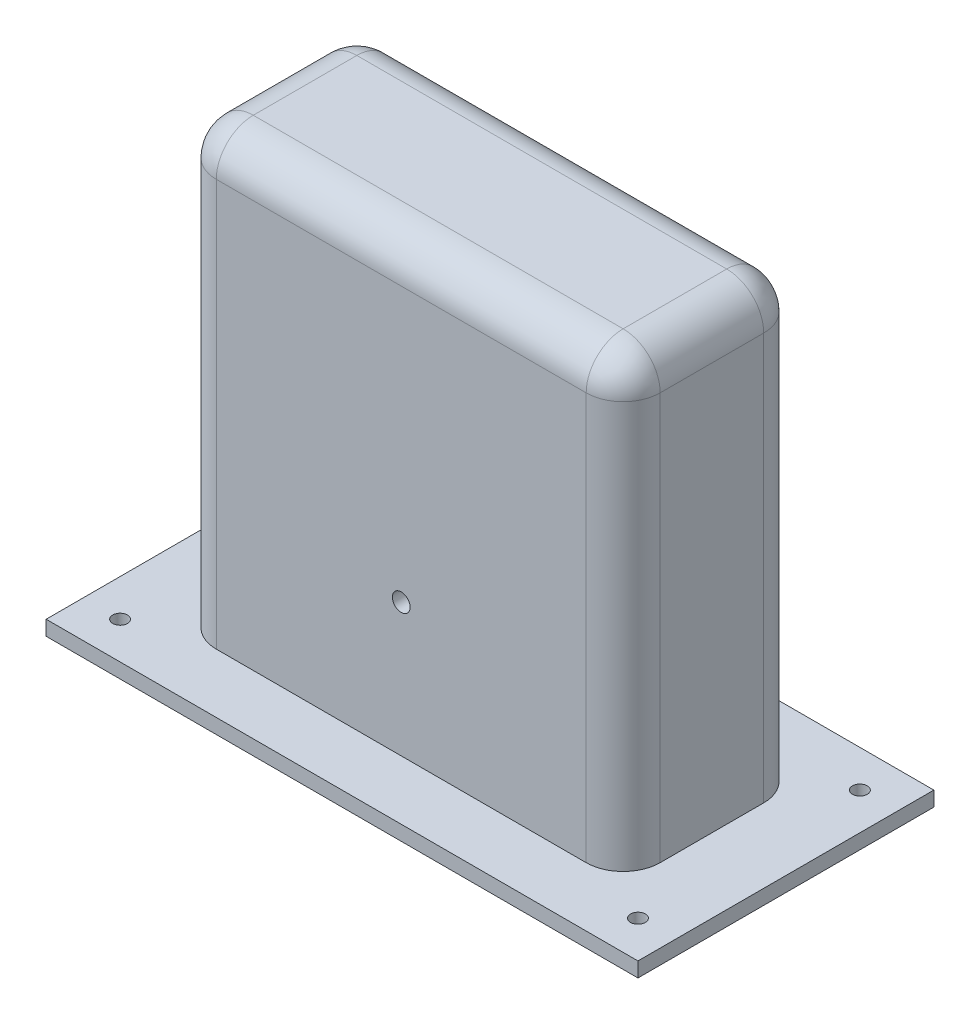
ISO-10303-21;
HEADER;
FILE_DESCRIPTION(('STEP AP214'),'2;1');
FILE_NAME('part.step','',(''),(''),'','','');
FILE_SCHEMA(('AUTOMOTIVE_DESIGN { 1 0 10303 214 1 1 1 1 }'));
ENDSEC;
DATA;
#1=APPLICATION_CONTEXT('core data for automotive mechanical design processes');
#2=APPLICATION_PROTOCOL_DEFINITION('international standard','automotive_design',2000,#1);
#3=PRODUCT_CONTEXT('',#1,'mechanical');
#4=PRODUCT('Part','Part','',(#3));
#5=PRODUCT_RELATED_PRODUCT_CATEGORY('part','',(#4));
#6=PRODUCT_DEFINITION_FORMATION('','',#4);
#7=PRODUCT_DEFINITION_CONTEXT('part definition',#1,'design');
#8=PRODUCT_DEFINITION('design','',#6,#7);
#9=PRODUCT_DEFINITION_SHAPE('','',#8);
#10=(LENGTH_UNIT() NAMED_UNIT(*) SI_UNIT(.MILLI.,.METRE.));
#11=(NAMED_UNIT(*) PLANE_ANGLE_UNIT() SI_UNIT($,.RADIAN.));
#12=(NAMED_UNIT(*) SI_UNIT($,.STERADIAN.) SOLID_ANGLE_UNIT());
#13=UNCERTAINTY_MEASURE_WITH_UNIT(LENGTH_MEASURE(1.E-05),#10,'distance_accuracy_value','');
#14=(GEOMETRIC_REPRESENTATION_CONTEXT(3) GLOBAL_UNCERTAINTY_ASSIGNED_CONTEXT((#13)) GLOBAL_UNIT_ASSIGNED_CONTEXT((#10,
#11,#12)) REPRESENTATION_CONTEXT('',''));
#15=CARTESIAN_POINT('',(0.,0.,0.));
#16=DIRECTION('',(0.,0.,1.));
#17=DIRECTION('',(1.,0.,0.));
#18=AXIS2_PLACEMENT_3D('',#15,#16,#17);
#19=CARTESIAN_POINT('',(0.,10.,0.));
#20=DIRECTION('',(0.,1.,0.));
#21=DIRECTION('',(0.,0.,1.));
#22=AXIS2_PLACEMENT_3D('',#19,#20,#21);
#23=PLANE('',#22);
#24=CARTESIAN_POINT('',(-175.,10.,-75.));
#25=DIRECTION('',(0.,1.,0.));
#26=DIRECTION('',(0.,0.,1.));
#27=AXIS2_PLACEMENT_3D('',#24,#25,#26);
#28=CIRCLE('',#27,5.00000000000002);
#29=CARTESIAN_POINT('',(-175.,10.,-70.));
#30=VERTEX_POINT('',#29);
#31=EDGE_CURVE('E445',#30,#30,#28,.T.);
#32=ORIENTED_EDGE('',*,*,#31,.F.);
#33=EDGE_LOOP('',(#32));
#34=FACE_BOUND('',#33,.T.);
#35=CARTESIAN_POINT('',(175.,10.,-75.));
#36=DIRECTION('',(0.,1.,0.));
#37=DIRECTION('',(0.,0.,1.));
#38=AXIS2_PLACEMENT_3D('',#35,#36,#37);
#39=CIRCLE('',#38,5.00000000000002);
#40=CARTESIAN_POINT('',(175.,10.,-70.));
#41=VERTEX_POINT('',#40);
#42=EDGE_CURVE('E457',#41,#41,#39,.T.);
#43=ORIENTED_EDGE('',*,*,#42,.F.);
#44=EDGE_LOOP('',(#43));
#45=FACE_BOUND('',#44,.T.);
#46=DIRECTION('',(0.,0.,-1.));
#47=VECTOR('',#46,1.);
#48=CARTESIAN_POINT('',(200.,10.,-100.));
#49=LINE('',#48,#47);
#50=CARTESIAN_POINT('',(200.,10.,100.));
#51=VERTEX_POINT('',#50);
#52=CARTESIAN_POINT('',(200.,10.,-100.));
#53=VERTEX_POINT('',#52);
#54=EDGE_CURVE('E208',#51,#53,#49,.T.);
#55=ORIENTED_EDGE('',*,*,#54,.T.);
#56=DIRECTION('',(-1.,0.,0.));
#57=VECTOR('',#56,1.);
#58=CARTESIAN_POINT('',(-200.,10.,-100.));
#59=LINE('',#58,#57);
#60=CARTESIAN_POINT('',(-200.,10.,-100.));
#61=VERTEX_POINT('',#60);
#62=EDGE_CURVE('E197',#53,#61,#59,.T.);
#63=ORIENTED_EDGE('',*,*,#62,.T.);
#64=DIRECTION('',(0.,0.,1.));
#65=VECTOR('',#64,1.);
#66=CARTESIAN_POINT('',(-200.,10.,-100.));
#67=LINE('',#66,#65);
#68=CARTESIAN_POINT('',(-200.,10.,100.));
#69=VERTEX_POINT('',#68);
#70=EDGE_CURVE('E207',#61,#69,#67,.T.);
#71=ORIENTED_EDGE('',*,*,#70,.T.);
#72=DIRECTION('',(1.,0.,0.));
#73=VECTOR('',#72,1.);
#74=CARTESIAN_POINT('',(-200.,10.,100.));
#75=LINE('',#74,#73);
#76=EDGE_CURVE('E213',#69,#51,#75,.T.);
#77=ORIENTED_EDGE('',*,*,#76,.T.);
#78=EDGE_LOOP('',(#55,#63,#71,#77));
#79=FACE_BOUND('',#78,.T.);
#80=CARTESIAN_POINT('',(175.,10.,75.0000000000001));
#81=DIRECTION('',(0.,1.,0.));
#82=DIRECTION('',(0.,0.,1.));
#83=AXIS2_PLACEMENT_3D('',#80,#81,#82);
#84=CIRCLE('',#83,5.00000000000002);
#85=CARTESIAN_POINT('',(175.,10.,80.0000000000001));
#86=VERTEX_POINT('',#85);
#87=EDGE_CURVE('E451',#86,#86,#84,.T.);
#88=ORIENTED_EDGE('',*,*,#87,.F.);
#89=EDGE_LOOP('',(#88));
#90=FACE_BOUND('',#89,.T.);
#91=CARTESIAN_POINT('',(-175.,10.,75.0000000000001));
#92=DIRECTION('',(0.,1.,0.));
#93=DIRECTION('',(0.,0.,1.));
#94=AXIS2_PLACEMENT_3D('',#91,#92,#93);
#95=CIRCLE('',#94,5.00000000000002);
#96=CARTESIAN_POINT('',(-175.,10.,80.0000000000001));
#97=VERTEX_POINT('',#96);
#98=EDGE_CURVE('E439',#97,#97,#95,.T.);
#99=ORIENTED_EDGE('',*,*,#98,.F.);
#100=EDGE_LOOP('',(#99));
#101=FACE_BOUND('',#100,.T.);
#102=DIRECTION('',(-1.,0.,0.));
#103=VECTOR('',#102,1.);
#104=CARTESIAN_POINT('',(-150.,10.,-60.));
#105=LINE('',#104,#103);
#106=CARTESIAN_POINT('',(125.,10.,-60.));
#107=VERTEX_POINT('',#106);
#108=CARTESIAN_POINT('',(-125.,10.,-60.));
#109=VERTEX_POINT('',#108);
#110=EDGE_CURVE('E431',#107,#109,#105,.T.);
#111=ORIENTED_EDGE('',*,*,#110,.F.);
#112=CARTESIAN_POINT('',(125.,10.,-35.));
#113=DIRECTION('',(0.,1.,0.));
#114=DIRECTION('',(0.,0.,1.));
#115=AXIS2_PLACEMENT_3D('',#112,#113,#114);
#116=CIRCLE('',#115,25.);
#117=CARTESIAN_POINT('',(150.,10.,-35.));
#118=VERTEX_POINT('',#117);
#119=EDGE_CURVE('E315',#107,#118,#116,.F.);
#120=ORIENTED_EDGE('',*,*,#119,.T.);
#121=DIRECTION('',(0.,0.,-1.));
#122=VECTOR('',#121,1.);
#123=CARTESIAN_POINT('',(150.,10.,-60.));
#124=LINE('',#123,#122);
#125=CARTESIAN_POINT('',(150.,10.,35.));
#126=VERTEX_POINT('',#125);
#127=EDGE_CURVE('E355',#126,#118,#124,.T.);
#128=ORIENTED_EDGE('',*,*,#127,.F.);
#129=CARTESIAN_POINT('',(125.,10.,35.));
#130=DIRECTION('',(0.,1.,0.));
#131=DIRECTION('',(0.,0.,1.));
#132=AXIS2_PLACEMENT_3D('',#129,#130,#131);
#133=CIRCLE('',#132,25.);
#134=CARTESIAN_POINT('',(125.,10.,60.));
#135=VERTEX_POINT('',#134);
#136=EDGE_CURVE('E45',#126,#135,#133,.F.);
#137=ORIENTED_EDGE('',*,*,#136,.T.);
#138=DIRECTION('',(1.,0.,0.));
#139=VECTOR('',#138,1.);
#140=CARTESIAN_POINT('',(-150.,10.,60.));
#141=LINE('',#140,#139);
#142=CARTESIAN_POINT('',(-125.,10.,60.));
#143=VERTEX_POINT('',#142);
#144=EDGE_CURVE('E427',#143,#135,#141,.T.);
#145=ORIENTED_EDGE('',*,*,#144,.F.);
#146=CARTESIAN_POINT('',(-125.,10.,35.));
#147=DIRECTION('',(0.,1.,0.));
#148=DIRECTION('',(0.,0.,1.));
#149=AXIS2_PLACEMENT_3D('',#146,#147,#148);
#150=CIRCLE('',#149,25.);
#151=CARTESIAN_POINT('',(-150.,10.,35.));
#152=VERTEX_POINT('',#151);
#153=EDGE_CURVE('E11',#143,#152,#150,.F.);
#154=ORIENTED_EDGE('',*,*,#153,.T.);
#155=DIRECTION('',(0.,0.,1.));
#156=VECTOR('',#155,1.);
#157=CARTESIAN_POINT('',(-150.,10.,-60.));
#158=LINE('',#157,#156);
#159=CARTESIAN_POINT('',(-150.,10.,-35.));
#160=VERTEX_POINT('',#159);
#161=EDGE_CURVE('E425',#160,#152,#158,.T.);
#162=ORIENTED_EDGE('',*,*,#161,.F.);
#163=CARTESIAN_POINT('',(-125.,10.,-35.));
#164=DIRECTION('',(0.,1.,0.));
#165=DIRECTION('',(0.,0.,1.));
#166=AXIS2_PLACEMENT_3D('',#163,#164,#165);
#167=CIRCLE('',#166,25.);
#168=EDGE_CURVE('E313',#160,#109,#167,.F.);
#169=ORIENTED_EDGE('',*,*,#168,.T.);
#170=EDGE_LOOP('',(#111,#120,#128,#137,#145,#154,#162,#169));
#171=FACE_BOUND('',#170,.T.);
#172=ADVANCED_FACE('F36',(#34,#45,#79,#90,#101,#171),#23,.T.);
#173=CARTESIAN_POINT('',(0.,0.,0.));
#174=DIRECTION('',(0.,1.,0.));
#175=DIRECTION('',(0.,0.,1.));
#176=AXIS2_PLACEMENT_3D('',#173,#174,#175);
#177=PLANE('',#176);
#178=DIRECTION('',(0.,0.,-1.));
#179=VECTOR('',#178,1.);
#180=CARTESIAN_POINT('',(200.,0.,-100.));
#181=LINE('',#180,#179);
#182=CARTESIAN_POINT('',(200.,0.,100.));
#183=VERTEX_POINT('',#182);
#184=CARTESIAN_POINT('',(200.,0.,-100.));
#185=VERTEX_POINT('',#184);
#186=EDGE_CURVE('E221',#183,#185,#181,.T.);
#187=ORIENTED_EDGE('',*,*,#186,.F.);
#188=DIRECTION('',(1.,0.,0.));
#189=VECTOR('',#188,1.);
#190=CARTESIAN_POINT('',(-200.,0.,100.));
#191=LINE('',#190,#189);
#192=CARTESIAN_POINT('',(-200.,0.,100.));
#193=VERTEX_POINT('',#192);
#194=EDGE_CURVE('E217',#193,#183,#191,.T.);
#195=ORIENTED_EDGE('',*,*,#194,.F.);
#196=DIRECTION('',(0.,0.,1.));
#197=VECTOR('',#196,1.);
#198=CARTESIAN_POINT('',(-200.,0.,-100.));
#199=LINE('',#198,#197);
#200=CARTESIAN_POINT('',(-200.,0.,-100.));
#201=VERTEX_POINT('',#200);
#202=EDGE_CURVE('E468',#201,#193,#199,.T.);
#203=ORIENTED_EDGE('',*,*,#202,.F.);
#204=DIRECTION('',(-1.,0.,0.));
#205=VECTOR('',#204,1.);
#206=CARTESIAN_POINT('',(-200.,0.,-100.));
#207=LINE('',#206,#205);
#208=EDGE_CURVE('E466',#185,#201,#207,.T.);
#209=ORIENTED_EDGE('',*,*,#208,.F.);
#210=EDGE_LOOP('',(#187,#195,#203,#209));
#211=FACE_BOUND('',#210,.T.);
#212=CARTESIAN_POINT('',(175.,0.,-75.));
#213=DIRECTION('',(0.,1.,0.));
#214=DIRECTION('',(0.,0.,1.));
#215=AXIS2_PLACEMENT_3D('',#212,#213,#214);
#216=CIRCLE('',#215,5.00000000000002);
#217=CARTESIAN_POINT('',(175.,0.,-70.));
#218=VERTEX_POINT('',#217);
#219=EDGE_CURVE('E454',#218,#218,#216,.T.);
#220=ORIENTED_EDGE('',*,*,#219,.T.);
#221=EDGE_LOOP('',(#220));
#222=FACE_BOUND('',#221,.T.);
#223=CARTESIAN_POINT('',(175.,0.,75.0000000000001));
#224=DIRECTION('',(0.,1.,0.));
#225=DIRECTION('',(0.,0.,1.));
#226=AXIS2_PLACEMENT_3D('',#223,#224,#225);
#227=CIRCLE('',#226,5.00000000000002);
#228=CARTESIAN_POINT('',(175.,0.,80.0000000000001));
#229=VERTEX_POINT('',#228);
#230=EDGE_CURVE('E448',#229,#229,#227,.T.);
#231=ORIENTED_EDGE('',*,*,#230,.T.);
#232=EDGE_LOOP('',(#231));
#233=FACE_BOUND('',#232,.T.);
#234=CARTESIAN_POINT('',(-175.,0.,-75.));
#235=DIRECTION('',(0.,1.,0.));
#236=DIRECTION('',(0.,0.,1.));
#237=AXIS2_PLACEMENT_3D('',#234,#235,#236);
#238=CIRCLE('',#237,5.00000000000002);
#239=CARTESIAN_POINT('',(-175.,0.,-70.));
#240=VERTEX_POINT('',#239);
#241=EDGE_CURVE('E442',#240,#240,#238,.T.);
#242=ORIENTED_EDGE('',*,*,#241,.T.);
#243=EDGE_LOOP('',(#242));
#244=FACE_BOUND('',#243,.T.);
#245=CARTESIAN_POINT('',(-175.,0.,75.0000000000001));
#246=DIRECTION('',(0.,1.,0.));
#247=DIRECTION('',(0.,0.,1.));
#248=AXIS2_PLACEMENT_3D('',#245,#246,#247);
#249=CIRCLE('',#248,5.00000000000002);
#250=CARTESIAN_POINT('',(-175.,0.,80.0000000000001));
#251=VERTEX_POINT('',#250);
#252=EDGE_CURVE('E433',#251,#251,#249,.T.);
#253=ORIENTED_EDGE('',*,*,#252,.T.);
#254=EDGE_LOOP('',(#253));
#255=FACE_BOUND('',#254,.T.);
#256=ADVANCED_FACE('F479',(#211,#222,#233,#244,#255),#177,.F.);
#257=CARTESIAN_POINT('',(200.,10.,-100.));
#258=DIRECTION('',(-1.,0.,0.));
#259=DIRECTION('',(0.,0.,1.));
#260=AXIS2_PLACEMENT_3D('',#257,#258,#259);
#261=PLANE('',#260);
#262=ORIENTED_EDGE('',*,*,#186,.T.);
#263=DIRECTION('',(0.,-1.,0.));
#264=VECTOR('',#263,1.);
#265=CARTESIAN_POINT('',(200.,10.,-100.));
#266=LINE('',#265,#264);
#267=EDGE_CURVE('E201',#53,#185,#266,.T.);
#268=ORIENTED_EDGE('',*,*,#267,.F.);
#269=ORIENTED_EDGE('',*,*,#54,.F.);
#270=DIRECTION('',(0.,-1.,0.));
#271=VECTOR('',#270,1.);
#272=CARTESIAN_POINT('',(200.,10.,100.));
#273=LINE('',#272,#271);
#274=EDGE_CURVE('E464',#51,#183,#273,.T.);
#275=ORIENTED_EDGE('',*,*,#274,.T.);
#276=EDGE_LOOP('',(#262,#268,#269,#275));
#277=FACE_BOUND('',#276,.T.);
#278=ADVANCED_FACE('F219',(#277),#261,.F.);
#279=CARTESIAN_POINT('',(-200.,10.,-100.));
#280=DIRECTION('',(0.,0.,1.));
#281=DIRECTION('',(1.,0.,0.));
#282=AXIS2_PLACEMENT_3D('',#279,#280,#281);
#283=PLANE('',#282);
#284=ORIENTED_EDGE('',*,*,#208,.T.);
#285=DIRECTION('',(0.,-1.,0.));
#286=VECTOR('',#285,1.);
#287=CARTESIAN_POINT('',(-200.,10.,-100.));
#288=LINE('',#287,#286);
#289=EDGE_CURVE('E204',#61,#201,#288,.T.);
#290=ORIENTED_EDGE('',*,*,#289,.F.);
#291=ORIENTED_EDGE('',*,*,#62,.F.);
#292=ORIENTED_EDGE('',*,*,#267,.T.);
#293=EDGE_LOOP('',(#284,#290,#291,#292));
#294=FACE_BOUND('',#293,.T.);
#295=ADVANCED_FACE('F199',(#294),#283,.F.);
#296=CARTESIAN_POINT('',(-200.,10.,-100.));
#297=DIRECTION('',(1.,0.,0.));
#298=DIRECTION('',(0.,0.,-1.));
#299=AXIS2_PLACEMENT_3D('',#296,#297,#298);
#300=PLANE('',#299);
#301=ORIENTED_EDGE('',*,*,#202,.T.);
#302=DIRECTION('',(0.,-1.,0.));
#303=VECTOR('',#302,1.);
#304=CARTESIAN_POINT('',(-200.,10.,100.));
#305=LINE('',#304,#303);
#306=EDGE_CURVE('E227',#69,#193,#305,.T.);
#307=ORIENTED_EDGE('',*,*,#306,.F.);
#308=ORIENTED_EDGE('',*,*,#70,.F.);
#309=ORIENTED_EDGE('',*,*,#289,.T.);
#310=EDGE_LOOP('',(#301,#307,#308,#309));
#311=FACE_BOUND('',#310,.T.);
#312=ADVANCED_FACE('F481',(#311),#300,.F.);
#313=CARTESIAN_POINT('',(-200.,10.,100.));
#314=DIRECTION('',(0.,0.,-1.));
#315=DIRECTION('',(-1.,0.,0.));
#316=AXIS2_PLACEMENT_3D('',#313,#314,#315);
#317=PLANE('',#316);
#318=ORIENTED_EDGE('',*,*,#194,.T.);
#319=ORIENTED_EDGE('',*,*,#274,.F.);
#320=ORIENTED_EDGE('',*,*,#76,.F.);
#321=ORIENTED_EDGE('',*,*,#306,.T.);
#322=EDGE_LOOP('',(#318,#319,#320,#321));
#323=FACE_BOUND('',#322,.T.);
#324=ADVANCED_FACE('F475',(#323),#317,.F.);
#325=CARTESIAN_POINT('',(175.,10.,-75.));
#326=DIRECTION('',(0.,-1.,0.));
#327=DIRECTION('',(0.,0.,-1.));
#328=AXIS2_PLACEMENT_3D('',#325,#326,#327);
#329=CYLINDRICAL_SURFACE('',#328,5.00000000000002);
#330=ORIENTED_EDGE('',*,*,#42,.T.);
#331=EDGE_LOOP('',(#330));
#332=FACE_BOUND('',#331,.T.);
#333=ORIENTED_EDGE('',*,*,#219,.F.);
#334=EDGE_LOOP('',(#333));
#335=FACE_BOUND('',#334,.T.);
#336=ADVANCED_FACE('F488',(#332,#335),#329,.F.);
#337=CARTESIAN_POINT('',(175.,10.,75.0000000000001));
#338=DIRECTION('',(0.,-1.,0.));
#339=DIRECTION('',(0.,0.,-1.));
#340=AXIS2_PLACEMENT_3D('',#337,#338,#339);
#341=CYLINDRICAL_SURFACE('',#340,5.00000000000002);
#342=ORIENTED_EDGE('',*,*,#87,.T.);
#343=EDGE_LOOP('',(#342));
#344=FACE_BOUND('',#343,.T.);
#345=ORIENTED_EDGE('',*,*,#230,.F.);
#346=EDGE_LOOP('',(#345));
#347=FACE_BOUND('',#346,.T.);
#348=ADVANCED_FACE('F503',(#344,#347),#341,.F.);
#349=CARTESIAN_POINT('',(-175.,10.,-75.));
#350=DIRECTION('',(0.,-1.,0.));
#351=DIRECTION('',(0.,0.,-1.));
#352=AXIS2_PLACEMENT_3D('',#349,#350,#351);
#353=CYLINDRICAL_SURFACE('',#352,5.00000000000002);
#354=ORIENTED_EDGE('',*,*,#31,.T.);
#355=EDGE_LOOP('',(#354));
#356=FACE_BOUND('',#355,.T.);
#357=ORIENTED_EDGE('',*,*,#241,.F.);
#358=EDGE_LOOP('',(#357));
#359=FACE_BOUND('',#358,.T.);
#360=ADVANCED_FACE('F507',(#356,#359),#353,.F.);
#361=CARTESIAN_POINT('',(-175.,10.,75.0000000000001));
#362=DIRECTION('',(0.,-1.,0.));
#363=DIRECTION('',(0.,0.,-1.));
#364=AXIS2_PLACEMENT_3D('',#361,#362,#363);
#365=CYLINDRICAL_SURFACE('',#364,5.00000000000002);
#366=ORIENTED_EDGE('',*,*,#98,.T.);
#367=EDGE_LOOP('',(#366));
#368=FACE_BOUND('',#367,.T.);
#369=ORIENTED_EDGE('',*,*,#252,.F.);
#370=EDGE_LOOP('',(#369));
#371=FACE_BOUND('',#370,.T.);
#372=ADVANCED_FACE('F511',(#368,#371),#365,.F.);
#373=CARTESIAN_POINT('',(150.,310.,-60.));
#374=DIRECTION('',(-1.,0.,0.));
#375=DIRECTION('',(0.,0.,1.));
#376=AXIS2_PLACEMENT_3D('',#373,#374,#375);
#377=PLANE('',#376);
#378=ORIENTED_EDGE('',*,*,#127,.T.);
#379=DIRECTION('',(0.,-1.,0.));
#380=VECTOR('',#379,1.);
#381=CARTESIAN_POINT('',(150.,310.,-35.));
#382=LINE('',#381,#380);
#383=CARTESIAN_POINT('',(150.,285.,-35.));
#384=VERTEX_POINT('',#383);
#385=EDGE_CURVE('E53',#118,#384,#382,.F.);
#386=ORIENTED_EDGE('',*,*,#385,.T.);
#387=DIRECTION('',(0.,0.,-1.));
#388=VECTOR('',#387,1.);
#389=CARTESIAN_POINT('',(150.,285.,60.));
#390=LINE('',#389,#388);
#391=CARTESIAN_POINT('',(150.,285.,35.));
#392=VERTEX_POINT('',#391);
#393=EDGE_CURVE('E57',#384,#392,#390,.F.);
#394=ORIENTED_EDGE('',*,*,#393,.T.);
#395=DIRECTION('',(0.,-1.,0.));
#396=VECTOR('',#395,1.);
#397=CARTESIAN_POINT('',(150.,310.,35.));
#398=LINE('',#397,#396);
#399=EDGE_CURVE('E309',#392,#126,#398,.T.);
#400=ORIENTED_EDGE('',*,*,#399,.T.);
#401=EDGE_LOOP('',(#378,#386,#394,#400));
#402=FACE_BOUND('',#401,.T.);
#403=ADVANCED_FACE('F515',(#402),#377,.F.);
#404=CARTESIAN_POINT('',(-150.,310.,-60.));
#405=DIRECTION('',(0.,0.,1.));
#406=DIRECTION('',(1.,0.,0.));
#407=AXIS2_PLACEMENT_3D('',#404,#405,#406);
#408=PLANE('',#407);
#409=CARTESIAN_POINT('',(0.,100.,-60.));
#410=DIRECTION('',(0.,0.,-1.));
#411=DIRECTION('',(-1.,0.,0.));
#412=AXIS2_PLACEMENT_3D('',#409,#410,#411);
#413=CIRCLE('',#412,6.);
#414=CARTESIAN_POINT('',(-6.,100.,-60.));
#415=VERTEX_POINT('',#414);
#416=EDGE_CURVE('E981',#415,#415,#413,.T.);
#417=ORIENTED_EDGE('',*,*,#416,.F.);
#418=EDGE_LOOP('',(#417));
#419=FACE_BOUND('',#418,.T.);
#420=ORIENTED_EDGE('',*,*,#110,.T.);
#421=DIRECTION('',(0.,-1.,0.));
#422=VECTOR('',#421,1.);
#423=CARTESIAN_POINT('',(-125.,310.,-60.));
#424=LINE('',#423,#422);
#425=CARTESIAN_POINT('',(-125.,285.,-60.));
#426=VERTEX_POINT('',#425);
#427=EDGE_CURVE('E295',#109,#426,#424,.F.);
#428=ORIENTED_EDGE('',*,*,#427,.T.);
#429=DIRECTION('',(-1.,0.,0.));
#430=VECTOR('',#429,1.);
#431=CARTESIAN_POINT('',(150.,285.,-60.));
#432=LINE('',#431,#430);
#433=CARTESIAN_POINT('',(125.,285.,-60.));
#434=VERTEX_POINT('',#433);
#435=EDGE_CURVE('E292',#426,#434,#432,.F.);
#436=ORIENTED_EDGE('',*,*,#435,.T.);
#437=DIRECTION('',(0.,-1.,0.));
#438=VECTOR('',#437,1.);
#439=CARTESIAN_POINT('',(125.,310.,-60.));
#440=LINE('',#439,#438);
#441=EDGE_CURVE('E290',#434,#107,#440,.T.);
#442=ORIENTED_EDGE('',*,*,#441,.T.);
#443=EDGE_LOOP('',(#420,#428,#436,#442));
#444=FACE_BOUND('',#443,.T.);
#445=ADVANCED_FACE('F519',(#419,#444),#408,.F.);
#446=CARTESIAN_POINT('',(-150.,310.,-60.));
#447=DIRECTION('',(1.,0.,0.));
#448=DIRECTION('',(0.,0.,-1.));
#449=AXIS2_PLACEMENT_3D('',#446,#447,#448);
#450=PLANE('',#449);
#451=DIRECTION('',(0.,0.,1.));
#452=VECTOR('',#451,1.);
#453=CARTESIAN_POINT('',(-150.,285.,-60.));
#454=LINE('',#453,#452);
#455=CARTESIAN_POINT('',(-150.,285.,35.));
#456=VERTEX_POINT('',#455);
#457=CARTESIAN_POINT('',(-150.,285.,-35.));
#458=VERTEX_POINT('',#457);
#459=EDGE_CURVE('E299',#456,#458,#454,.F.);
#460=ORIENTED_EDGE('',*,*,#459,.T.);
#461=DIRECTION('',(0.,-1.,0.));
#462=VECTOR('',#461,1.);
#463=CARTESIAN_POINT('',(-150.,310.,-35.));
#464=LINE('',#463,#462);
#465=EDGE_CURVE('E301',#458,#160,#464,.T.);
#466=ORIENTED_EDGE('',*,*,#465,.T.);
#467=ORIENTED_EDGE('',*,*,#161,.T.);
#468=DIRECTION('',(0.,-1.,0.));
#469=VECTOR('',#468,1.);
#470=CARTESIAN_POINT('',(-150.,310.,35.));
#471=LINE('',#470,#469);
#472=EDGE_CURVE('E297',#152,#456,#471,.F.);
#473=ORIENTED_EDGE('',*,*,#472,.T.);
#474=EDGE_LOOP('',(#460,#466,#467,#473));
#475=FACE_BOUND('',#474,.T.);
#476=ADVANCED_FACE('F429',(#475),#450,.F.);
#477=CARTESIAN_POINT('',(-150.,310.,60.));
#478=DIRECTION('',(0.,0.,-1.));
#479=DIRECTION('',(-1.,0.,0.));
#480=AXIS2_PLACEMENT_3D('',#477,#478,#479);
#481=PLANE('',#480);
#482=CARTESIAN_POINT('',(0.,100.,60.));
#483=DIRECTION('',(0.,0.,-1.));
#484=DIRECTION('',(-1.,0.,0.));
#485=AXIS2_PLACEMENT_3D('',#482,#483,#484);
#486=CIRCLE('',#485,6.);
#487=CARTESIAN_POINT('',(-6.,100.,60.));
#488=VERTEX_POINT('',#487);
#489=EDGE_CURVE('E359',#488,#488,#486,.T.);
#490=ORIENTED_EDGE('',*,*,#489,.T.);
#491=EDGE_LOOP('',(#490));
#492=FACE_BOUND('',#491,.T.);
#493=ORIENTED_EDGE('',*,*,#144,.T.);
#494=DIRECTION('',(0.,-1.,0.));
#495=VECTOR('',#494,1.);
#496=CARTESIAN_POINT('',(125.,310.,60.));
#497=LINE('',#496,#495);
#498=CARTESIAN_POINT('',(125.,285.,60.));
#499=VERTEX_POINT('',#498);
#500=EDGE_CURVE('E307',#135,#499,#497,.F.);
#501=ORIENTED_EDGE('',*,*,#500,.T.);
#502=DIRECTION('',(1.,0.,0.));
#503=VECTOR('',#502,1.);
#504=CARTESIAN_POINT('',(-150.,285.,60.));
#505=LINE('',#504,#503);
#506=CARTESIAN_POINT('',(-125.,285.,60.));
#507=VERTEX_POINT('',#506);
#508=EDGE_CURVE('E305',#499,#507,#505,.F.);
#509=ORIENTED_EDGE('',*,*,#508,.T.);
#510=DIRECTION('',(0.,-1.,0.));
#511=VECTOR('',#510,1.);
#512=CARTESIAN_POINT('',(-125.,310.,60.));
#513=LINE('',#512,#511);
#514=EDGE_CURVE('E303',#507,#143,#513,.T.);
#515=ORIENTED_EDGE('',*,*,#514,.T.);
#516=EDGE_LOOP('',(#493,#501,#509,#515));
#517=FACE_BOUND('',#516,.T.);
#518=ADVANCED_FACE('F413',(#492,#517),#481,.F.);
#519=CARTESIAN_POINT('',(0.,310.,0.));
#520=DIRECTION('',(0.,1.,0.));
#521=DIRECTION('',(0.,0.,1.));
#522=AXIS2_PLACEMENT_3D('',#519,#520,#521);
#523=PLANE('',#522);
#524=DIRECTION('',(0.,0.,-1.));
#525=VECTOR('',#524,1.);
#526=CARTESIAN_POINT('',(125.,310.,-60.));
#527=LINE('',#526,#525);
#528=CARTESIAN_POINT('',(125.,310.,35.));
#529=VERTEX_POINT('',#528);
#530=CARTESIAN_POINT('',(125.,310.,-35.));
#531=VERTEX_POINT('',#530);
#532=EDGE_CURVE('E281',#529,#531,#527,.T.);
#533=ORIENTED_EDGE('',*,*,#532,.T.);
#534=DIRECTION('',(-1.,0.,0.));
#535=VECTOR('',#534,1.);
#536=CARTESIAN_POINT('',(-150.,310.,-35.));
#537=LINE('',#536,#535);
#538=CARTESIAN_POINT('',(-125.,310.,-35.));
#539=VERTEX_POINT('',#538);
#540=EDGE_CURVE('E287',#531,#539,#537,.T.);
#541=ORIENTED_EDGE('',*,*,#540,.T.);
#542=DIRECTION('',(0.,0.,1.));
#543=VECTOR('',#542,1.);
#544=CARTESIAN_POINT('',(-125.,310.,60.));
#545=LINE('',#544,#543);
#546=CARTESIAN_POINT('',(-125.,310.,35.));
#547=VERTEX_POINT('',#546);
#548=EDGE_CURVE('E285',#539,#547,#545,.T.);
#549=ORIENTED_EDGE('',*,*,#548,.T.);
#550=DIRECTION('',(1.,0.,0.));
#551=VECTOR('',#550,1.);
#552=CARTESIAN_POINT('',(150.,310.,35.));
#553=LINE('',#552,#551);
#554=EDGE_CURVE('E283',#547,#529,#553,.T.);
#555=ORIENTED_EDGE('',*,*,#554,.T.);
#556=EDGE_LOOP('',(#533,#541,#549,#555));
#557=FACE_BOUND('',#556,.T.);
#558=ADVANCED_FACE('F402',(#557),#523,.T.);
#559=CARTESIAN_POINT('',(125.,310.,35.));
#560=DIRECTION('',(0.,-1.,0.));
#561=DIRECTION('',(0.,0.,-1.));
#562=AXIS2_PLACEMENT_3D('',#559,#560,#561);
#563=CYLINDRICAL_SURFACE('',#562,25.);
#564=ORIENTED_EDGE('',*,*,#136,.F.);
#565=ORIENTED_EDGE('',*,*,#399,.F.);
#566=CARTESIAN_POINT('',(125.,285.,35.));
#567=DIRECTION('',(0.,1.,0.));
#568=DIRECTION('',(0.,0.,1.));
#569=AXIS2_PLACEMENT_3D('',#566,#567,#568);
#570=CIRCLE('',#569,25.);
#571=EDGE_CURVE('E322',#499,#392,#570,.T.);
#572=ORIENTED_EDGE('',*,*,#571,.F.);
#573=ORIENTED_EDGE('',*,*,#500,.F.);
#574=EDGE_LOOP('',(#564,#565,#572,#573));
#575=FACE_BOUND('',#574,.T.);
#576=ADVANCED_FACE('F38',(#575),#563,.T.);
#577=CARTESIAN_POINT('',(0.,285.,35.));
#578=DIRECTION('',(-1.,0.,0.));
#579=DIRECTION('',(0.,0.,1.));
#580=AXIS2_PLACEMENT_3D('',#577,#578,#579);
#581=CYLINDRICAL_SURFACE('',#580,25.);
#582=CARTESIAN_POINT('',(-125.,285.,35.));
#583=DIRECTION('',(-1.,0.,0.));
#584=DIRECTION('',(0.,0.,1.));
#585=AXIS2_PLACEMENT_3D('',#582,#583,#584);
#586=CIRCLE('',#585,25.);
#587=EDGE_CURVE('E382',#507,#547,#586,.T.);
#588=ORIENTED_EDGE('',*,*,#587,.F.);
#589=ORIENTED_EDGE('',*,*,#508,.F.);
#590=CARTESIAN_POINT('',(125.,285.,35.));
#591=DIRECTION('',(1.,0.,0.));
#592=DIRECTION('',(0.,0.,-1.));
#593=AXIS2_PLACEMENT_3D('',#590,#591,#592);
#594=CIRCLE('',#593,25.);
#595=EDGE_CURVE('E385',#529,#499,#594,.T.);
#596=ORIENTED_EDGE('',*,*,#595,.F.);
#597=ORIENTED_EDGE('',*,*,#554,.F.);
#598=EDGE_LOOP('',(#588,#589,#596,#597));
#599=FACE_BOUND('',#598,.T.);
#600=ADVANCED_FACE('F409',(#599),#581,.T.);
#601=CARTESIAN_POINT('',(-125.,310.,35.));
#602=DIRECTION('',(0.,-1.,0.));
#603=DIRECTION('',(0.,0.,-1.));
#604=AXIS2_PLACEMENT_3D('',#601,#602,#603);
#605=CYLINDRICAL_SURFACE('',#604,25.);
#606=ORIENTED_EDGE('',*,*,#153,.F.);
#607=ORIENTED_EDGE('',*,*,#514,.F.);
#608=CARTESIAN_POINT('',(-125.,285.,35.));
#609=DIRECTION('',(0.,1.,0.));
#610=DIRECTION('',(0.,0.,1.));
#611=AXIS2_PLACEMENT_3D('',#608,#609,#610);
#612=CIRCLE('',#611,25.);
#613=EDGE_CURVE('E379',#456,#507,#612,.T.);
#614=ORIENTED_EDGE('',*,*,#613,.F.);
#615=ORIENTED_EDGE('',*,*,#472,.F.);
#616=EDGE_LOOP('',(#606,#607,#614,#615));
#617=FACE_BOUND('',#616,.T.);
#618=ADVANCED_FACE('F418',(#617),#605,.T.);
#619=CARTESIAN_POINT('',(125.,285.,35.));
#620=DIRECTION('',(0.,0.,1.));
#621=DIRECTION('',(1.,0.,0.));
#622=AXIS2_PLACEMENT_3D('',#619,#620,#621);
#623=SPHERICAL_SURFACE('',#622,25.);
#624=ORIENTED_EDGE('',*,*,#595,.T.);
#625=ORIENTED_EDGE('',*,*,#571,.T.);
#626=CARTESIAN_POINT('',(125.,285.,35.));
#627=DIRECTION('',(0.,0.,1.));
#628=DIRECTION('',(0.,-1.,0.));
#629=AXIS2_PLACEMENT_3D('',#626,#627,#628);
#630=CIRCLE('',#629,25.);
#631=EDGE_CURVE('E376',#529,#392,#630,.F.);
#632=ORIENTED_EDGE('',*,*,#631,.F.);
#633=EDGE_LOOP('',(#624,#625,#632));
#634=FACE_BOUND('',#633,.T.);
#635=ADVANCED_FACE('F391',(#634),#623,.T.);
#636=CARTESIAN_POINT('',(-125.,285.,35.));
#637=DIRECTION('',(0.,0.,1.));
#638=DIRECTION('',(1.,0.,0.));
#639=AXIS2_PLACEMENT_3D('',#636,#637,#638);
#640=SPHERICAL_SURFACE('',#639,25.);
#641=ORIENTED_EDGE('',*,*,#613,.T.);
#642=ORIENTED_EDGE('',*,*,#587,.T.);
#643=CARTESIAN_POINT('',(-125.,285.,35.));
#644=DIRECTION('',(0.,0.,1.));
#645=DIRECTION('',(1.,0.,0.));
#646=AXIS2_PLACEMENT_3D('',#643,#644,#645);
#647=CIRCLE('',#646,25.);
#648=EDGE_CURVE('E373',#456,#547,#647,.F.);
#649=ORIENTED_EDGE('',*,*,#648,.F.);
#650=EDGE_LOOP('',(#641,#642,#649));
#651=FACE_BOUND('',#650,.T.);
#652=ADVANCED_FACE('F571',(#651),#640,.T.);
#653=CARTESIAN_POINT('',(125.,310.,-35.));
#654=DIRECTION('',(0.,-1.,0.));
#655=DIRECTION('',(0.,0.,-1.));
#656=AXIS2_PLACEMENT_3D('',#653,#654,#655);
#657=CYLINDRICAL_SURFACE('',#656,25.);
#658=ORIENTED_EDGE('',*,*,#119,.F.);
#659=ORIENTED_EDGE('',*,*,#441,.F.);
#660=CARTESIAN_POINT('',(125.,285.,-35.));
#661=DIRECTION('',(0.,1.,0.));
#662=DIRECTION('',(0.,0.,1.));
#663=AXIS2_PLACEMENT_3D('',#660,#661,#662);
#664=CIRCLE('',#663,25.);
#665=EDGE_CURVE('E370',#384,#434,#664,.T.);
#666=ORIENTED_EDGE('',*,*,#665,.F.);
#667=ORIENTED_EDGE('',*,*,#385,.F.);
#668=EDGE_LOOP('',(#658,#659,#666,#667));
#669=FACE_BOUND('',#668,.T.);
#670=ADVANCED_FACE('F558',(#669),#657,.T.);
#671=CARTESIAN_POINT('',(125.,285.,0.));
#672=DIRECTION('',(0.,0.,1.));
#673=DIRECTION('',(1.,0.,0.));
#674=AXIS2_PLACEMENT_3D('',#671,#672,#673);
#675=CYLINDRICAL_SURFACE('',#674,25.);
#676=ORIENTED_EDGE('',*,*,#631,.T.);
#677=ORIENTED_EDGE('',*,*,#393,.F.);
#678=CARTESIAN_POINT('',(125.,285.,-35.));
#679=DIRECTION('',(0.,0.,-1.));
#680=DIRECTION('',(-1.,0.,0.));
#681=AXIS2_PLACEMENT_3D('',#678,#679,#680);
#682=CIRCLE('',#681,25.);
#683=EDGE_CURVE('E367',#531,#384,#682,.T.);
#684=ORIENTED_EDGE('',*,*,#683,.F.);
#685=ORIENTED_EDGE('',*,*,#532,.F.);
#686=EDGE_LOOP('',(#676,#677,#684,#685));
#687=FACE_BOUND('',#686,.T.);
#688=ADVANCED_FACE('F397',(#687),#675,.T.);
#689=CARTESIAN_POINT('',(-125.,285.,0.));
#690=DIRECTION('',(0.,0.,-1.));
#691=DIRECTION('',(-1.,0.,0.));
#692=AXIS2_PLACEMENT_3D('',#689,#690,#691);
#693=CYLINDRICAL_SURFACE('',#692,25.);
#694=ORIENTED_EDGE('',*,*,#648,.T.);
#695=ORIENTED_EDGE('',*,*,#548,.F.);
#696=CARTESIAN_POINT('',(-125.,285.,-35.));
#697=DIRECTION('',(0.,0.,-1.));
#698=DIRECTION('',(-1.,0.,0.));
#699=AXIS2_PLACEMENT_3D('',#696,#697,#698);
#700=CIRCLE('',#699,25.);
#701=EDGE_CURVE('E364',#458,#539,#700,.T.);
#702=ORIENTED_EDGE('',*,*,#701,.F.);
#703=ORIENTED_EDGE('',*,*,#459,.F.);
#704=EDGE_LOOP('',(#694,#695,#702,#703));
#705=FACE_BOUND('',#704,.T.);
#706=ADVANCED_FACE('F569',(#705),#693,.T.);
#707=CARTESIAN_POINT('',(-125.,310.,-35.));
#708=DIRECTION('',(0.,-1.,0.));
#709=DIRECTION('',(0.,0.,-1.));
#710=AXIS2_PLACEMENT_3D('',#707,#708,#709);
#711=CYLINDRICAL_SURFACE('',#710,25.);
#712=ORIENTED_EDGE('',*,*,#168,.F.);
#713=ORIENTED_EDGE('',*,*,#465,.F.);
#714=CARTESIAN_POINT('',(-125.,285.,-35.));
#715=DIRECTION('',(0.,1.,0.));
#716=DIRECTION('',(0.,0.,1.));
#717=AXIS2_PLACEMENT_3D('',#714,#715,#716);
#718=CIRCLE('',#717,25.);
#719=EDGE_CURVE('E361',#426,#458,#718,.T.);
#720=ORIENTED_EDGE('',*,*,#719,.F.);
#721=ORIENTED_EDGE('',*,*,#427,.F.);
#722=EDGE_LOOP('',(#712,#713,#720,#721));
#723=FACE_BOUND('',#722,.T.);
#724=ADVANCED_FACE('F734',(#723),#711,.T.);
#725=CARTESIAN_POINT('',(125.,285.,-35.));
#726=DIRECTION('',(0.,0.,1.));
#727=DIRECTION('',(1.,0.,0.));
#728=AXIS2_PLACEMENT_3D('',#725,#726,#727);
#729=SPHERICAL_SURFACE('',#728,25.);
#730=ORIENTED_EDGE('',*,*,#683,.T.);
#731=ORIENTED_EDGE('',*,*,#665,.T.);
#732=CARTESIAN_POINT('',(125.,285.,-35.));
#733=DIRECTION('',(1.,0.,0.));
#734=DIRECTION('',(0.,1.,0.));
#735=AXIS2_PLACEMENT_3D('',#732,#733,#734);
#736=CIRCLE('',#735,25.);
#737=EDGE_CURVE('E358',#531,#434,#736,.F.);
#738=ORIENTED_EDGE('',*,*,#737,.F.);
#739=EDGE_LOOP('',(#730,#731,#738));
#740=FACE_BOUND('',#739,.T.);
#741=ADVANCED_FACE('F561',(#740),#729,.T.);
#742=CARTESIAN_POINT('',(-125.,285.,-35.));
#743=DIRECTION('',(0.,0.,1.));
#744=DIRECTION('',(1.,0.,0.));
#745=AXIS2_PLACEMENT_3D('',#742,#743,#744);
#746=SPHERICAL_SURFACE('',#745,25.);
#747=ORIENTED_EDGE('',*,*,#719,.T.);
#748=ORIENTED_EDGE('',*,*,#701,.T.);
#749=CARTESIAN_POINT('',(-125.,285.,-35.));
#750=DIRECTION('',(-1.,0.,0.));
#751=DIRECTION('',(0.,0.,1.));
#752=AXIS2_PLACEMENT_3D('',#749,#750,#751);
#753=CIRCLE('',#752,25.);
#754=EDGE_CURVE('E356',#426,#539,#753,.F.);
#755=ORIENTED_EDGE('',*,*,#754,.F.);
#756=EDGE_LOOP('',(#747,#748,#755));
#757=FACE_BOUND('',#756,.T.);
#758=ADVANCED_FACE('F541',(#757),#746,.T.);
#759=CARTESIAN_POINT('',(0.,285.,-35.));
#760=DIRECTION('',(1.,0.,0.));
#761=DIRECTION('',(0.,0.,-1.));
#762=AXIS2_PLACEMENT_3D('',#759,#760,#761);
#763=CYLINDRICAL_SURFACE('',#762,25.);
#764=ORIENTED_EDGE('',*,*,#737,.T.);
#765=ORIENTED_EDGE('',*,*,#435,.F.);
#766=ORIENTED_EDGE('',*,*,#754,.T.);
#767=ORIENTED_EDGE('',*,*,#540,.F.);
#768=EDGE_LOOP('',(#764,#765,#766,#767));
#769=FACE_BOUND('',#768,.T.);
#770=ADVANCED_FACE('F533',(#769),#763,.T.);
#771=CARTESIAN_POINT('',(0.,100.,100.));
#772=DIRECTION('',(0.,0.,-1.));
#773=DIRECTION('',(-1.,0.,0.));
#774=AXIS2_PLACEMENT_3D('',#771,#772,#773);
#775=CYLINDRICAL_SURFACE('',#774,6.);
#776=CARTESIAN_POINT('',(0.,100.,50.));
#777=DIRECTION('',(0.,0.,-1.));
#778=DIRECTION('',(-1.,0.,0.));
#779=AXIS2_PLACEMENT_3D('',#776,#777,#778);
#780=CIRCLE('',#779,6.);
#781=CARTESIAN_POINT('',(-6.,100.,50.));
#782=VERTEX_POINT('',#781);
#783=EDGE_CURVE('E40',#782,#782,#780,.T.);
#784=ORIENTED_EDGE('',*,*,#783,.T.);
#785=EDGE_LOOP('',(#784));
#786=FACE_BOUND('',#785,.T.);
#787=ORIENTED_EDGE('',*,*,#489,.F.);
#788=EDGE_LOOP('',(#787));
#789=FACE_BOUND('',#788,.T.);
#790=ADVANCED_FACE('F530',(#786,#789),#775,.F.);
#791=CARTESIAN_POINT('',(0.,100.,-50.));
#792=DIRECTION('',(0.,0.,1.));
#793=DIRECTION('',(1.,0.,0.));
#794=AXIS2_PLACEMENT_3D('',#791,#792,#793);
#795=CIRCLE('',#794,6.);
#796=CARTESIAN_POINT('',(6.,100.,-50.));
#797=VERTEX_POINT('',#796);
#798=EDGE_CURVE('E549',#797,#797,#795,.T.);
#799=ORIENTED_EDGE('',*,*,#798,.T.);
#800=EDGE_LOOP('',(#799));
#801=FACE_BOUND('',#800,.T.);
#802=ORIENTED_EDGE('',*,*,#416,.T.);
#803=EDGE_LOOP('',(#802));
#804=FACE_BOUND('',#803,.T.);
#805=ADVANCED_FACE('F532',(#801,#804),#775,.F.);
#806=CARTESIAN_POINT('',(0.,10.,0.));
#807=DIRECTION('',(0.,1.,0.));
#808=DIRECTION('',(0.,0.,1.));
#809=AXIS2_PLACEMENT_3D('',#806,#807,#808);
#810=PLANE('',#809);
#811=DIRECTION('',(1.,0.,0.));
#812=VECTOR('',#811,1.);
#813=CARTESIAN_POINT('',(0.,10.,-50.));
#814=LINE('',#813,#812);
#815=CARTESIAN_POINT('',(-115.,10.,-50.));
#816=VERTEX_POINT('',#815);
#817=CARTESIAN_POINT('',(115.,10.,-50.));
#818=VERTEX_POINT('',#817);
#819=EDGE_CURVE('E235',#816,#818,#814,.T.);
#820=ORIENTED_EDGE('',*,*,#819,.F.);
#821=CARTESIAN_POINT('',(-115.,10.,-25.));
#822=DIRECTION('',(0.,1.,0.));
#823=DIRECTION('',(0.,0.,1.));
#824=AXIS2_PLACEMENT_3D('',#821,#822,#823);
#825=CIRCLE('',#824,25.);
#826=CARTESIAN_POINT('',(-140.,10.,-25.));
#827=VERTEX_POINT('',#826);
#828=EDGE_CURVE('E252',#816,#827,#825,.T.);
#829=ORIENTED_EDGE('',*,*,#828,.T.);
#830=DIRECTION('',(0.,0.,-1.));
#831=VECTOR('',#830,1.);
#832=CARTESIAN_POINT('',(-140.,10.,0.));
#833=LINE('',#832,#831);
#834=CARTESIAN_POINT('',(-140.,10.,25.));
#835=VERTEX_POINT('',#834);
#836=EDGE_CURVE('E225',#835,#827,#833,.T.);
#837=ORIENTED_EDGE('',*,*,#836,.F.);
#838=CARTESIAN_POINT('',(-115.,10.,25.));
#839=DIRECTION('',(0.,1.,0.));
#840=DIRECTION('',(0.,0.,1.));
#841=AXIS2_PLACEMENT_3D('',#838,#839,#840);
#842=CIRCLE('',#841,25.);
#843=CARTESIAN_POINT('',(-115.,10.,50.));
#844=VERTEX_POINT('',#843);
#845=EDGE_CURVE('E250',#835,#844,#842,.T.);
#846=ORIENTED_EDGE('',*,*,#845,.T.);
#847=DIRECTION('',(-1.,0.,0.));
#848=VECTOR('',#847,1.);
#849=CARTESIAN_POINT('',(0.,10.,50.));
#850=LINE('',#849,#848);
#851=CARTESIAN_POINT('',(115.,10.,50.));
#852=VERTEX_POINT('',#851);
#853=EDGE_CURVE('E222',#852,#844,#850,.T.);
#854=ORIENTED_EDGE('',*,*,#853,.F.);
#855=CARTESIAN_POINT('',(115.,10.,25.));
#856=DIRECTION('',(0.,1.,0.));
#857=DIRECTION('',(0.,0.,1.));
#858=AXIS2_PLACEMENT_3D('',#855,#856,#857);
#859=CIRCLE('',#858,25.);
#860=CARTESIAN_POINT('',(140.,10.,25.));
#861=VERTEX_POINT('',#860);
#862=EDGE_CURVE('E248',#852,#861,#859,.T.);
#863=ORIENTED_EDGE('',*,*,#862,.T.);
#864=DIRECTION('',(0.,0.,1.));
#865=VECTOR('',#864,1.);
#866=CARTESIAN_POINT('',(140.,10.,0.));
#867=LINE('',#866,#865);
#868=CARTESIAN_POINT('',(140.,10.,-25.));
#869=VERTEX_POINT('',#868);
#870=EDGE_CURVE('E231',#869,#861,#867,.T.);
#871=ORIENTED_EDGE('',*,*,#870,.F.);
#872=CARTESIAN_POINT('',(115.,10.,-25.));
#873=DIRECTION('',(0.,1.,0.));
#874=DIRECTION('',(0.,0.,1.));
#875=AXIS2_PLACEMENT_3D('',#872,#873,#874);
#876=CIRCLE('',#875,25.);
#877=EDGE_CURVE('E246',#869,#818,#876,.T.);
#878=ORIENTED_EDGE('',*,*,#877,.T.);
#879=EDGE_LOOP('',(#820,#829,#837,#846,#854,#863,#871,#878));
#880=FACE_BOUND('',#879,.T.);
#881=ADVANCED_FACE('F539',(#880),#810,.T.);
#882=CARTESIAN_POINT('',(140.,310.,-60.));
#883=DIRECTION('',(-1.,0.,0.));
#884=DIRECTION('',(0.,0.,1.));
#885=AXIS2_PLACEMENT_3D('',#882,#883,#884);
#886=PLANE('',#885);
#887=ORIENTED_EDGE('',*,*,#870,.T.);
#888=DIRECTION('',(0.,-1.,0.));
#889=VECTOR('',#888,1.);
#890=CARTESIAN_POINT('',(140.,300.,25.));
#891=LINE('',#890,#889);
#892=CARTESIAN_POINT('',(140.,275.,25.));
#893=VERTEX_POINT('',#892);
#894=EDGE_CURVE('E270',#861,#893,#891,.F.);
#895=ORIENTED_EDGE('',*,*,#894,.T.);
#896=DIRECTION('',(0.,0.,-1.));
#897=VECTOR('',#896,1.);
#898=CARTESIAN_POINT('',(140.,275.,-60.));
#899=LINE('',#898,#897);
#900=CARTESIAN_POINT('',(140.,275.,-25.));
#901=VERTEX_POINT('',#900);
#902=EDGE_CURVE('E268',#893,#901,#899,.T.);
#903=ORIENTED_EDGE('',*,*,#902,.T.);
#904=DIRECTION('',(0.,-1.,0.));
#905=VECTOR('',#904,1.);
#906=CARTESIAN_POINT('',(140.,10.,-25.));
#907=LINE('',#906,#905);
#908=EDGE_CURVE('E266',#901,#869,#907,.T.);
#909=ORIENTED_EDGE('',*,*,#908,.T.);
#910=EDGE_LOOP('',(#887,#895,#903,#909));
#911=FACE_BOUND('',#910,.T.);
#912=ADVANCED_FACE('F661',(#911),#886,.T.);
#913=CARTESIAN_POINT('',(-150.,310.,-50.));
#914=DIRECTION('',(0.,0.,1.));
#915=DIRECTION('',(1.,0.,0.));
#916=AXIS2_PLACEMENT_3D('',#913,#914,#915);
#917=PLANE('',#916);
#918=ORIENTED_EDGE('',*,*,#798,.F.);
#919=EDGE_LOOP('',(#918));
#920=FACE_BOUND('',#919,.T.);
#921=DIRECTION('',(-1.,0.,0.));
#922=VECTOR('',#921,1.);
#923=CARTESIAN_POINT('',(-150.,275.,-50.));
#924=LINE('',#923,#922);
#925=CARTESIAN_POINT('',(115.,275.,-50.));
#926=VERTEX_POINT('',#925);
#927=CARTESIAN_POINT('',(-115.,275.,-50.));
#928=VERTEX_POINT('',#927);
#929=EDGE_CURVE('E234',#926,#928,#924,.T.);
#930=ORIENTED_EDGE('',*,*,#929,.T.);
#931=DIRECTION('',(0.,-1.,0.));
#932=VECTOR('',#931,1.);
#933=CARTESIAN_POINT('',(-115.,10.,-50.));
#934=LINE('',#933,#932);
#935=EDGE_CURVE('E243',#928,#816,#934,.T.);
#936=ORIENTED_EDGE('',*,*,#935,.T.);
#937=ORIENTED_EDGE('',*,*,#819,.T.);
#938=DIRECTION('',(0.,-1.,0.));
#939=VECTOR('',#938,1.);
#940=CARTESIAN_POINT('',(115.,300.,-50.));
#941=LINE('',#940,#939);
#942=EDGE_CURVE('E241',#818,#926,#941,.F.);
#943=ORIENTED_EDGE('',*,*,#942,.T.);
#944=EDGE_LOOP('',(#930,#936,#937,#943));
#945=FACE_BOUND('',#944,.T.);
#946=ADVANCED_FACE('F665',(#920,#945),#917,.T.);
#947=CARTESIAN_POINT('',(-140.,310.,-60.));
#948=DIRECTION('',(1.,0.,0.));
#949=DIRECTION('',(0.,0.,-1.));
#950=AXIS2_PLACEMENT_3D('',#947,#948,#949);
#951=PLANE('',#950);
#952=ORIENTED_EDGE('',*,*,#836,.T.);
#953=DIRECTION('',(0.,-1.,0.));
#954=VECTOR('',#953,1.);
#955=CARTESIAN_POINT('',(-140.,300.,-25.));
#956=LINE('',#955,#954);
#957=CARTESIAN_POINT('',(-140.,275.,-25.));
#958=VERTEX_POINT('',#957);
#959=EDGE_CURVE('E258',#827,#958,#956,.F.);
#960=ORIENTED_EDGE('',*,*,#959,.T.);
#961=DIRECTION('',(0.,0.,1.));
#962=VECTOR('',#961,1.);
#963=CARTESIAN_POINT('',(-140.,275.,-60.));
#964=LINE('',#963,#962);
#965=CARTESIAN_POINT('',(-140.,275.,25.));
#966=VERTEX_POINT('',#965);
#967=EDGE_CURVE('E254',#958,#966,#964,.T.);
#968=ORIENTED_EDGE('',*,*,#967,.T.);
#969=DIRECTION('',(0.,-1.,0.));
#970=VECTOR('',#969,1.);
#971=CARTESIAN_POINT('',(-140.,10.,25.));
#972=LINE('',#971,#970);
#973=EDGE_CURVE('E256',#966,#835,#972,.T.);
#974=ORIENTED_EDGE('',*,*,#973,.T.);
#975=EDGE_LOOP('',(#952,#960,#968,#974));
#976=FACE_BOUND('',#975,.T.);
#977=ADVANCED_FACE('F669',(#976),#951,.T.);
#978=CARTESIAN_POINT('',(-150.,310.,50.));
#979=DIRECTION('',(0.,0.,-1.));
#980=DIRECTION('',(-1.,0.,0.));
#981=AXIS2_PLACEMENT_3D('',#978,#979,#980);
#982=PLANE('',#981);
#983=ORIENTED_EDGE('',*,*,#783,.F.);
#984=EDGE_LOOP('',(#983));
#985=FACE_BOUND('',#984,.T.);
#986=ORIENTED_EDGE('',*,*,#853,.T.);
#987=DIRECTION('',(0.,-1.,0.));
#988=VECTOR('',#987,1.);
#989=CARTESIAN_POINT('',(-115.,300.,50.));
#990=LINE('',#989,#988);
#991=CARTESIAN_POINT('',(-115.,275.,50.));
#992=VERTEX_POINT('',#991);
#993=EDGE_CURVE('E264',#844,#992,#990,.F.);
#994=ORIENTED_EDGE('',*,*,#993,.T.);
#995=DIRECTION('',(1.,0.,0.));
#996=VECTOR('',#995,1.);
#997=CARTESIAN_POINT('',(-150.,275.,50.));
#998=LINE('',#997,#996);
#999=CARTESIAN_POINT('',(115.,275.,50.));
#1000=VERTEX_POINT('',#999);
#1001=EDGE_CURVE('E260',#992,#1000,#998,.T.);
#1002=ORIENTED_EDGE('',*,*,#1001,.T.);
#1003=DIRECTION('',(0.,-1.,0.));
#1004=VECTOR('',#1003,1.);
#1005=CARTESIAN_POINT('',(115.,10.,50.));
#1006=LINE('',#1005,#1004);
#1007=EDGE_CURVE('E262',#1000,#852,#1006,.T.);
#1008=ORIENTED_EDGE('',*,*,#1007,.T.);
#1009=EDGE_LOOP('',(#986,#994,#1002,#1008));
#1010=FACE_BOUND('',#1009,.T.);
#1011=ADVANCED_FACE('F673',(#985,#1010),#982,.T.);
#1012=CARTESIAN_POINT('',(0.,300.,0.));
#1013=DIRECTION('',(0.,1.,0.));
#1014=DIRECTION('',(0.,0.,1.));
#1015=AXIS2_PLACEMENT_3D('',#1012,#1013,#1014);
#1016=PLANE('',#1015);
#1017=DIRECTION('',(-1.,0.,0.));
#1018=VECTOR('',#1017,1.);
#1019=CARTESIAN_POINT('',(0.,300.,-25.));
#1020=LINE('',#1019,#1018);
#1021=CARTESIAN_POINT('',(-115.,300.,-25.));
#1022=VERTEX_POINT('',#1021);
#1023=CARTESIAN_POINT('',(115.,300.,-25.));
#1024=VERTEX_POINT('',#1023);
#1025=EDGE_CURVE('E276',#1022,#1024,#1020,.F.);
#1026=ORIENTED_EDGE('',*,*,#1025,.T.);
#1027=DIRECTION('',(0.,0.,-1.));
#1028=VECTOR('',#1027,1.);
#1029=CARTESIAN_POINT('',(115.,300.,0.));
#1030=LINE('',#1029,#1028);
#1031=CARTESIAN_POINT('',(115.,300.,25.));
#1032=VERTEX_POINT('',#1031);
#1033=EDGE_CURVE('E278',#1024,#1032,#1030,.F.);
#1034=ORIENTED_EDGE('',*,*,#1033,.T.);
#1035=DIRECTION('',(1.,0.,0.));
#1036=VECTOR('',#1035,1.);
#1037=CARTESIAN_POINT('',(0.,300.,25.));
#1038=LINE('',#1037,#1036);
#1039=CARTESIAN_POINT('',(-115.,300.,25.));
#1040=VERTEX_POINT('',#1039);
#1041=EDGE_CURVE('E272',#1032,#1040,#1038,.F.);
#1042=ORIENTED_EDGE('',*,*,#1041,.T.);
#1043=DIRECTION('',(0.,0.,1.));
#1044=VECTOR('',#1043,1.);
#1045=CARTESIAN_POINT('',(-115.,300.,0.));
#1046=LINE('',#1045,#1044);
#1047=EDGE_CURVE('E274',#1040,#1022,#1046,.F.);
#1048=ORIENTED_EDGE('',*,*,#1047,.T.);
#1049=EDGE_LOOP('',(#1026,#1034,#1042,#1048));
#1050=FACE_BOUND('',#1049,.T.);
#1051=ADVANCED_FACE('F677',(#1050),#1016,.F.);
#1052=CARTESIAN_POINT('',(115.,310.,25.));
#1053=DIRECTION('',(0.,1.,0.));
#1054=DIRECTION('',(0.,0.,1.));
#1055=AXIS2_PLACEMENT_3D('',#1052,#1053,#1054);
#1056=CYLINDRICAL_SURFACE('',#1055,25.);
#1057=CARTESIAN_POINT('',(115.,275.,25.));
#1058=DIRECTION('',(0.,-1.,0.));
#1059=DIRECTION('',(0.,0.,-1.));
#1060=AXIS2_PLACEMENT_3D('',#1057,#1058,#1059);
#1061=CIRCLE('',#1060,25.);
#1062=EDGE_CURVE('E352',#893,#1000,#1061,.T.);
#1063=ORIENTED_EDGE('',*,*,#1062,.F.);
#1064=ORIENTED_EDGE('',*,*,#894,.F.);
#1065=ORIENTED_EDGE('',*,*,#862,.F.);
#1066=ORIENTED_EDGE('',*,*,#1007,.F.);
#1067=EDGE_LOOP('',(#1063,#1064,#1065,#1066));
#1068=FACE_BOUND('',#1067,.T.);
#1069=ADVANCED_FACE('F681',(#1068),#1056,.F.);
#1070=CARTESIAN_POINT('',(115.,275.,25.));
#1071=DIRECTION('',(0.,0.,1.));
#1072=DIRECTION('',(1.,0.,0.));
#1073=AXIS2_PLACEMENT_3D('',#1070,#1071,#1072);
#1074=SPHERICAL_SURFACE('',#1073,25.);
#1075=CARTESIAN_POINT('',(115.,275.,25.));
#1076=DIRECTION('',(0.,0.,-1.));
#1077=DIRECTION('',(-1.,0.,0.));
#1078=AXIS2_PLACEMENT_3D('',#1075,#1076,#1077);
#1079=CIRCLE('',#1078,25.);
#1080=EDGE_CURVE('E346',#893,#1032,#1079,.F.);
#1081=ORIENTED_EDGE('',*,*,#1080,.F.);
#1082=ORIENTED_EDGE('',*,*,#1062,.T.);
#1083=CARTESIAN_POINT('',(115.,275.,25.));
#1084=DIRECTION('',(-1.,0.,0.));
#1085=DIRECTION('',(0.,-1.,0.));
#1086=AXIS2_PLACEMENT_3D('',#1083,#1084,#1085);
#1087=CIRCLE('',#1086,25.);
#1088=EDGE_CURVE('E349',#1032,#1000,#1087,.F.);
#1089=ORIENTED_EDGE('',*,*,#1088,.F.);
#1090=EDGE_LOOP('',(#1081,#1082,#1089));
#1091=FACE_BOUND('',#1090,.T.);
#1092=ADVANCED_FACE('F722',(#1091),#1074,.F.);
#1093=CARTESIAN_POINT('',(-115.,310.,25.));
#1094=DIRECTION('',(0.,1.,0.));
#1095=DIRECTION('',(0.,0.,1.));
#1096=AXIS2_PLACEMENT_3D('',#1093,#1094,#1095);
#1097=CYLINDRICAL_SURFACE('',#1096,25.);
#1098=ORIENTED_EDGE('',*,*,#845,.F.);
#1099=ORIENTED_EDGE('',*,*,#973,.F.);
#1100=CARTESIAN_POINT('',(-115.,275.,25.));
#1101=DIRECTION('',(0.,-1.,0.));
#1102=DIRECTION('',(0.,0.,-1.));
#1103=AXIS2_PLACEMENT_3D('',#1100,#1101,#1102);
#1104=CIRCLE('',#1103,25.);
#1105=EDGE_CURVE('E343',#992,#966,#1104,.T.);
#1106=ORIENTED_EDGE('',*,*,#1105,.F.);
#1107=ORIENTED_EDGE('',*,*,#993,.F.);
#1108=EDGE_LOOP('',(#1098,#1099,#1106,#1107));
#1109=FACE_BOUND('',#1108,.T.);
#1110=ADVANCED_FACE('F718',(#1109),#1097,.F.);
#1111=CARTESIAN_POINT('',(-150.,275.,25.));
#1112=DIRECTION('',(1.,0.,0.));
#1113=DIRECTION('',(0.,0.,-1.));
#1114=AXIS2_PLACEMENT_3D('',#1111,#1112,#1113);
#1115=CYLINDRICAL_SURFACE('',#1114,25.);
#1116=ORIENTED_EDGE('',*,*,#1088,.T.);
#1117=ORIENTED_EDGE('',*,*,#1001,.F.);
#1118=CARTESIAN_POINT('',(-115.,275.,25.));
#1119=DIRECTION('',(1.,0.,0.));
#1120=DIRECTION('',(0.,0.,-1.));
#1121=AXIS2_PLACEMENT_3D('',#1118,#1119,#1120);
#1122=CIRCLE('',#1121,25.);
#1123=EDGE_CURVE('E340',#1040,#992,#1122,.T.);
#1124=ORIENTED_EDGE('',*,*,#1123,.F.);
#1125=ORIENTED_EDGE('',*,*,#1041,.F.);
#1126=EDGE_LOOP('',(#1116,#1117,#1124,#1125));
#1127=FACE_BOUND('',#1126,.T.);
#1128=ADVANCED_FACE('F714',(#1127),#1115,.F.);
#1129=CARTESIAN_POINT('',(115.,275.,-60.));
#1130=DIRECTION('',(0.,0.,-1.));
#1131=DIRECTION('',(-1.,0.,0.));
#1132=AXIS2_PLACEMENT_3D('',#1129,#1130,#1131);
#1133=CYLINDRICAL_SURFACE('',#1132,25.);
#1134=ORIENTED_EDGE('',*,*,#1080,.T.);
#1135=ORIENTED_EDGE('',*,*,#1033,.F.);
#1136=CARTESIAN_POINT('',(115.,275.,-25.));
#1137=DIRECTION('',(0.,0.,1.));
#1138=DIRECTION('',(1.,0.,0.));
#1139=AXIS2_PLACEMENT_3D('',#1136,#1137,#1138);
#1140=CIRCLE('',#1139,25.);
#1141=EDGE_CURVE('E337',#901,#1024,#1140,.T.);
#1142=ORIENTED_EDGE('',*,*,#1141,.F.);
#1143=ORIENTED_EDGE('',*,*,#902,.F.);
#1144=EDGE_LOOP('',(#1134,#1135,#1142,#1143));
#1145=FACE_BOUND('',#1144,.T.);
#1146=ADVANCED_FACE('F710',(#1145),#1133,.F.);
#1147=CARTESIAN_POINT('',(115.,310.,-25.));
#1148=DIRECTION('',(0.,1.,0.));
#1149=DIRECTION('',(0.,0.,1.));
#1150=AXIS2_PLACEMENT_3D('',#1147,#1148,#1149);
#1151=CYLINDRICAL_SURFACE('',#1150,25.);
#1152=ORIENTED_EDGE('',*,*,#877,.F.);
#1153=ORIENTED_EDGE('',*,*,#908,.F.);
#1154=CARTESIAN_POINT('',(115.,275.,-25.));
#1155=DIRECTION('',(0.,-1.,0.));
#1156=DIRECTION('',(0.,0.,-1.));
#1157=AXIS2_PLACEMENT_3D('',#1154,#1155,#1156);
#1158=CIRCLE('',#1157,25.);
#1159=EDGE_CURVE('E334',#926,#901,#1158,.T.);
#1160=ORIENTED_EDGE('',*,*,#1159,.F.);
#1161=ORIENTED_EDGE('',*,*,#942,.F.);
#1162=EDGE_LOOP('',(#1152,#1153,#1160,#1161));
#1163=FACE_BOUND('',#1162,.T.);
#1164=ADVANCED_FACE('F706',(#1163),#1151,.F.);
#1165=CARTESIAN_POINT('',(-115.,275.,25.));
#1166=DIRECTION('',(0.,0.,1.));
#1167=DIRECTION('',(1.,0.,0.));
#1168=AXIS2_PLACEMENT_3D('',#1165,#1166,#1167);
#1169=SPHERICAL_SURFACE('',#1168,25.);
#1170=ORIENTED_EDGE('',*,*,#1123,.T.);
#1171=ORIENTED_EDGE('',*,*,#1105,.T.);
#1172=CARTESIAN_POINT('',(-115.,275.,25.));
#1173=DIRECTION('',(0.,0.,-1.));
#1174=DIRECTION('',(-1.,0.,0.));
#1175=AXIS2_PLACEMENT_3D('',#1172,#1173,#1174);
#1176=CIRCLE('',#1175,25.);
#1177=EDGE_CURVE('E331',#1040,#966,#1176,.F.);
#1178=ORIENTED_EDGE('',*,*,#1177,.F.);
#1179=EDGE_LOOP('',(#1170,#1171,#1178));
#1180=FACE_BOUND('',#1179,.T.);
#1181=ADVANCED_FACE('F702',(#1180),#1169,.F.);
#1182=CARTESIAN_POINT('',(115.,275.,-25.));
#1183=DIRECTION('',(0.,0.,1.));
#1184=DIRECTION('',(1.,0.,0.));
#1185=AXIS2_PLACEMENT_3D('',#1182,#1183,#1184);
#1186=SPHERICAL_SURFACE('',#1185,25.);
#1187=ORIENTED_EDGE('',*,*,#1159,.T.);
#1188=ORIENTED_EDGE('',*,*,#1141,.T.);
#1189=CARTESIAN_POINT('',(115.,275.,-25.));
#1190=DIRECTION('',(-1.,0.,0.));
#1191=DIRECTION('',(0.,0.,1.));
#1192=AXIS2_PLACEMENT_3D('',#1189,#1190,#1191);
#1193=CIRCLE('',#1192,25.);
#1194=EDGE_CURVE('E328',#926,#1024,#1193,.F.);
#1195=ORIENTED_EDGE('',*,*,#1194,.F.);
#1196=EDGE_LOOP('',(#1187,#1188,#1195));
#1197=FACE_BOUND('',#1196,.T.);
#1198=ADVANCED_FACE('F698',(#1197),#1186,.F.);
#1199=CARTESIAN_POINT('',(-115.,275.,-60.));
#1200=DIRECTION('',(0.,0.,1.));
#1201=DIRECTION('',(1.,0.,0.));
#1202=AXIS2_PLACEMENT_3D('',#1199,#1200,#1201);
#1203=CYLINDRICAL_SURFACE('',#1202,25.);
#1204=ORIENTED_EDGE('',*,*,#1177,.T.);
#1205=ORIENTED_EDGE('',*,*,#967,.F.);
#1206=CARTESIAN_POINT('',(-115.,275.,-25.));
#1207=DIRECTION('',(0.,0.,1.));
#1208=DIRECTION('',(1.,0.,0.));
#1209=AXIS2_PLACEMENT_3D('',#1206,#1207,#1208);
#1210=CIRCLE('',#1209,25.);
#1211=EDGE_CURVE('E325',#1022,#958,#1210,.T.);
#1212=ORIENTED_EDGE('',*,*,#1211,.F.);
#1213=ORIENTED_EDGE('',*,*,#1047,.F.);
#1214=EDGE_LOOP('',(#1204,#1205,#1212,#1213));
#1215=FACE_BOUND('',#1214,.T.);
#1216=ADVANCED_FACE('F694',(#1215),#1203,.F.);
#1217=CARTESIAN_POINT('',(-150.,275.,-25.));
#1218=DIRECTION('',(-1.,0.,0.));
#1219=DIRECTION('',(0.,0.,1.));
#1220=AXIS2_PLACEMENT_3D('',#1217,#1218,#1219);
#1221=CYLINDRICAL_SURFACE('',#1220,25.);
#1222=ORIENTED_EDGE('',*,*,#1194,.T.);
#1223=ORIENTED_EDGE('',*,*,#1025,.F.);
#1224=CARTESIAN_POINT('',(-115.,275.,-25.));
#1225=DIRECTION('',(1.,0.,0.));
#1226=DIRECTION('',(0.,0.,-1.));
#1227=AXIS2_PLACEMENT_3D('',#1224,#1225,#1226);
#1228=CIRCLE('',#1227,25.);
#1229=EDGE_CURVE('E321',#928,#1022,#1228,.T.);
#1230=ORIENTED_EDGE('',*,*,#1229,.F.);
#1231=ORIENTED_EDGE('',*,*,#929,.F.);
#1232=EDGE_LOOP('',(#1222,#1223,#1230,#1231));
#1233=FACE_BOUND('',#1232,.T.);
#1234=ADVANCED_FACE('F690',(#1233),#1221,.F.);
#1235=CARTESIAN_POINT('',(-115.,275.,-25.));
#1236=DIRECTION('',(0.,0.,1.));
#1237=DIRECTION('',(1.,0.,0.));
#1238=AXIS2_PLACEMENT_3D('',#1235,#1236,#1237);
#1239=SPHERICAL_SURFACE('',#1238,25.);
#1240=ORIENTED_EDGE('',*,*,#1229,.T.);
#1241=ORIENTED_EDGE('',*,*,#1211,.T.);
#1242=CARTESIAN_POINT('',(-115.,275.,-25.));
#1243=DIRECTION('',(0.,-1.,0.));
#1244=DIRECTION('',(0.,0.,-1.));
#1245=AXIS2_PLACEMENT_3D('',#1242,#1243,#1244);
#1246=CIRCLE('',#1245,25.);
#1247=EDGE_CURVE('E318',#928,#958,#1246,.F.);
#1248=ORIENTED_EDGE('',*,*,#1247,.F.);
#1249=EDGE_LOOP('',(#1240,#1241,#1248));
#1250=FACE_BOUND('',#1249,.T.);
#1251=ADVANCED_FACE('F686',(#1250),#1239,.F.);
#1252=CARTESIAN_POINT('',(-115.,310.,-25.));
#1253=DIRECTION('',(0.,1.,0.));
#1254=DIRECTION('',(0.,0.,1.));
#1255=AXIS2_PLACEMENT_3D('',#1252,#1253,#1254);
#1256=CYLINDRICAL_SURFACE('',#1255,25.);
#1257=ORIENTED_EDGE('',*,*,#1247,.T.);
#1258=ORIENTED_EDGE('',*,*,#959,.F.);
#1259=ORIENTED_EDGE('',*,*,#828,.F.);
#1260=ORIENTED_EDGE('',*,*,#935,.F.);
#1261=EDGE_LOOP('',(#1257,#1258,#1259,#1260));
#1262=FACE_BOUND('',#1261,.T.);
#1263=ADVANCED_FACE('F683',(#1262),#1256,.F.);
#1264=CLOSED_SHELL('',(#172,#256,#278,#295,#312,#324,#336,#348,#360,#372,#403,#445,#476,#518,
#558,#576,#600,#618,#635,#652,#670,#688,#706,#724,#741,#758,#770,#790,#805,#881,#912,#946,#977,
#1011,#1051,#1069,#1092,#1110,#1128,#1146,#1164,#1181,#1198,#1216,#1234,#1251,#1263));
#1265=MANIFOLD_SOLID_BREP('B2',#1264);
#1266=ADVANCED_BREP_SHAPE_REPRESENTATION('',(#18,#1265),#14);
#1267=SHAPE_DEFINITION_REPRESENTATION(#9,#1266);
ENDSEC;
END-ISO-10303-21;
